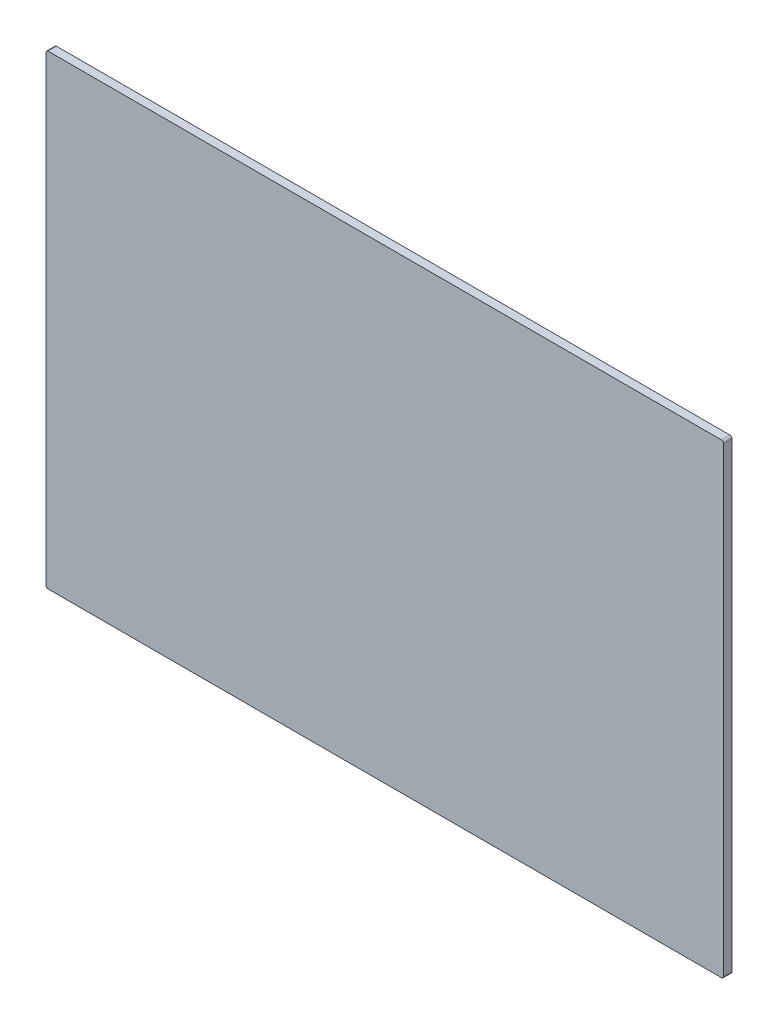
from build123d import *

# Parameters (mm, degrees)
EXTRUSION1_DEPTH = 6


with BuildPart() as part:
    # Esquisse1 → Extrusion1 (new body)
    with BuildSketch(Plane.XY):
        with BuildLine():
            Line((1.5, 0), (478.5, 0))
            ThreePointArc((478.5, 0), (479.560660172, 0.439339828), (480, 1.5))
            Line((480, 1.5), (480, 328.5))
            ThreePointArc((480, 328.5), (479.560660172, 329.560660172), (478.5, 330))
            Line((478.5, 330), (1.5, 330))
            ThreePointArc((1.5, 330), (0.439339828, 329.560660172), (0, 328.5))
            Line((0, 328.5), (0, 1.5))
            ThreePointArc((0, 1.5), (0.439339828, 0.439339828), (1.5, 0))
        make_face()
    extrude(amount=EXTRUSION1_DEPTH)


solid = part.part
